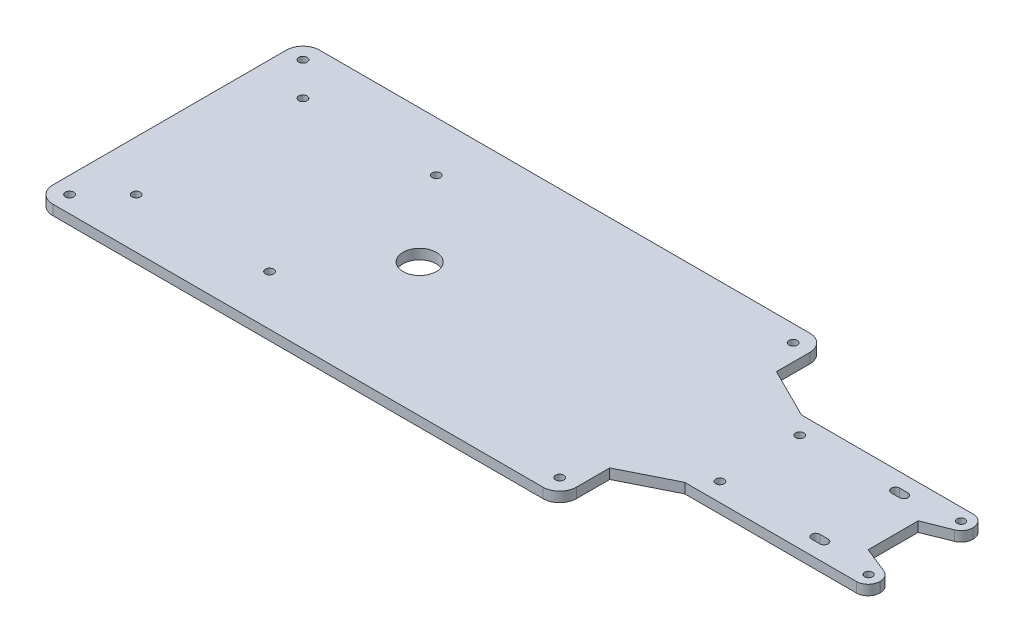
ISO-10303-21;
HEADER;
FILE_DESCRIPTION(('STEP AP214'),'2;1');
FILE_NAME('part.step','',(''),(''),'','','');
FILE_SCHEMA(('AUTOMOTIVE_DESIGN { 1 0 10303 214 1 1 1 1 }'));
ENDSEC;
DATA;
#1=APPLICATION_CONTEXT('core data for automotive mechanical design processes');
#2=APPLICATION_PROTOCOL_DEFINITION('international standard','automotive_design',2000,#1);
#3=PRODUCT_CONTEXT('',#1,'mechanical');
#4=PRODUCT('Part','Part','',(#3));
#5=PRODUCT_RELATED_PRODUCT_CATEGORY('part','',(#4));
#6=PRODUCT_DEFINITION_FORMATION('','',#4);
#7=PRODUCT_DEFINITION_CONTEXT('part definition',#1,'design');
#8=PRODUCT_DEFINITION('design','',#6,#7);
#9=PRODUCT_DEFINITION_SHAPE('','',#8);
#10=(LENGTH_UNIT() NAMED_UNIT(*) SI_UNIT(.MILLI.,.METRE.));
#11=(NAMED_UNIT(*) PLANE_ANGLE_UNIT() SI_UNIT($,.RADIAN.));
#12=(NAMED_UNIT(*) SI_UNIT($,.STERADIAN.) SOLID_ANGLE_UNIT());
#13=UNCERTAINTY_MEASURE_WITH_UNIT(LENGTH_MEASURE(1.E-05),#10,'distance_accuracy_value','');
#14=(GEOMETRIC_REPRESENTATION_CONTEXT(3) GLOBAL_UNCERTAINTY_ASSIGNED_CONTEXT((#13)) GLOBAL_UNIT_ASSIGNED_CONTEXT((#10,
#11,#12)) REPRESENTATION_CONTEXT('',''));
#15=CARTESIAN_POINT('',(0.,0.,0.));
#16=DIRECTION('',(0.,0.,1.));
#17=DIRECTION('',(1.,0.,0.));
#18=AXIS2_PLACEMENT_3D('',#15,#16,#17);
#19=CARTESIAN_POINT('',(223.5,3.,-14.));
#20=DIRECTION('',(0.,-1.,0.));
#21=DIRECTION('',(0.,0.,-1.));
#22=AXIS2_PLACEMENT_3D('',#19,#20,#21);
#23=PLANE('',#22);
#24=CARTESIAN_POINT('',(75.,3.,0.));
#25=DIRECTION('',(0.,1.,0.));
#26=DIRECTION('',(0.,0.,1.));
#27=AXIS2_PLACEMENT_3D('',#24,#25,#26);
#28=CIRCLE('',#27,5.);
#29=CARTESIAN_POINT('',(75.,3.,5.));
#30=VERTEX_POINT('',#29);
#31=EDGE_CURVE('E323',#30,#30,#28,.T.);
#32=ORIENTED_EDGE('',*,*,#31,.F.);
#33=EDGE_LOOP('',(#32));
#34=FACE_BOUND('',#33,.T.);
#35=CARTESIAN_POINT('',(177.024019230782,3.,11.975));
#36=DIRECTION('',(0.,1.,0.));
#37=DIRECTION('',(0.,0.,1.));
#38=AXIS2_PLACEMENT_3D('',#35,#36,#37);
#39=CIRCLE('',#38,1.25000000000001);
#40=CARTESIAN_POINT('',(177.024019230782,3.,13.225));
#41=VERTEX_POINT('',#40);
#42=EDGE_CURVE('E289',#41,#41,#39,.T.);
#43=ORIENTED_EDGE('',*,*,#42,.F.);
#44=EDGE_LOOP('',(#43));
#45=FACE_BOUND('',#44,.T.);
#46=DIRECTION('',(1.,0.,0.));
#47=VECTOR('',#46,1.);
#48=CARTESIAN_POINT('',(205.725980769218,3.,-10.725));
#49=LINE('',#48,#47);
#50=CARTESIAN_POINT('',(205.725980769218,3.,-10.725));
#51=VERTEX_POINT('',#50);
#52=CARTESIAN_POINT('',(208.225980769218,3.,-10.725));
#53=VERTEX_POINT('',#52);
#54=EDGE_CURVE('E447',#51,#53,#49,.T.);
#55=ORIENTED_EDGE('',*,*,#54,.F.);
#56=CARTESIAN_POINT('',(205.725980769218,3.,-11.975));
#57=DIRECTION('',(0.,1.,0.));
#58=DIRECTION('',(0.,0.,1.));
#59=AXIS2_PLACEMENT_3D('',#56,#57,#58);
#60=CIRCLE('',#59,1.25);
#61=CARTESIAN_POINT('',(205.725980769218,3.,-13.225));
#62=VERTEX_POINT('',#61);
#63=EDGE_CURVE('E68',#62,#51,#60,.T.);
#64=ORIENTED_EDGE('',*,*,#63,.F.);
#65=DIRECTION('',(-1.,0.,0.));
#66=VECTOR('',#65,1.);
#67=CARTESIAN_POINT('',(205.725980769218,3.,-13.225));
#68=LINE('',#67,#66);
#69=CARTESIAN_POINT('',(208.225980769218,3.,-13.225));
#70=VERTEX_POINT('',#69);
#71=EDGE_CURVE('E460',#70,#62,#68,.T.);
#72=ORIENTED_EDGE('',*,*,#71,.F.);
#73=CARTESIAN_POINT('',(208.225980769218,3.,-11.975));
#74=DIRECTION('',(0.,1.,0.));
#75=DIRECTION('',(0.,0.,1.));
#76=AXIS2_PLACEMENT_3D('',#73,#74,#75);
#77=CIRCLE('',#76,1.25);
#78=EDGE_CURVE('E453',#53,#70,#77,.T.);
#79=ORIENTED_EDGE('',*,*,#78,.F.);
#80=EDGE_LOOP('',(#55,#64,#72,#79));
#81=FACE_BOUND('',#80,.T.);
#82=DIRECTION('',(1.,0.,0.));
#83=VECTOR('',#82,1.);
#84=CARTESIAN_POINT('',(205.725980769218,3.,13.225));
#85=LINE('',#84,#83);
#86=CARTESIAN_POINT('',(205.725980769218,3.,13.225));
#87=VERTEX_POINT('',#86);
#88=CARTESIAN_POINT('',(208.225980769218,3.,13.225));
#89=VERTEX_POINT('',#88);
#90=EDGE_CURVE('E273',#87,#89,#85,.T.);
#91=ORIENTED_EDGE('',*,*,#90,.F.);
#92=CARTESIAN_POINT('',(205.725980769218,3.,11.975));
#93=DIRECTION('',(0.,1.,0.));
#94=DIRECTION('',(0.,0.,1.));
#95=AXIS2_PLACEMENT_3D('',#92,#93,#94);
#96=CIRCLE('',#95,1.25);
#97=CARTESIAN_POINT('',(205.725980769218,3.,10.725));
#98=VERTEX_POINT('',#97);
#99=EDGE_CURVE('E76',#98,#87,#96,.T.);
#100=ORIENTED_EDGE('',*,*,#99,.F.);
#101=DIRECTION('',(-1.,0.,0.));
#102=VECTOR('',#101,1.);
#103=CARTESIAN_POINT('',(205.725980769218,3.,10.725));
#104=LINE('',#103,#102);
#105=CARTESIAN_POINT('',(208.225980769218,3.,10.725));
#106=VERTEX_POINT('',#105);
#107=EDGE_CURVE('E260',#106,#98,#104,.T.);
#108=ORIENTED_EDGE('',*,*,#107,.F.);
#109=CARTESIAN_POINT('',(208.225980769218,3.,11.975));
#110=DIRECTION('',(0.,1.,0.));
#111=DIRECTION('',(0.,0.,1.));
#112=AXIS2_PLACEMENT_3D('',#109,#110,#111);
#113=CIRCLE('',#112,1.25);
#114=EDGE_CURVE('E267',#89,#106,#113,.T.);
#115=ORIENTED_EDGE('',*,*,#114,.F.);
#116=EDGE_LOOP('',(#91,#100,#108,#115));
#117=FACE_BOUND('',#116,.T.);
#118=CARTESIAN_POINT('',(177.024019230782,3.,-11.975));
#119=DIRECTION('',(0.,1.,0.));
#120=DIRECTION('',(0.,0.,1.));
#121=AXIS2_PLACEMENT_3D('',#118,#119,#120);
#122=CIRCLE('',#121,1.25000000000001);
#123=CARTESIAN_POINT('',(177.024019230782,3.,-10.725));
#124=VERTEX_POINT('',#123);
#125=EDGE_CURVE('E439',#124,#124,#122,.T.);
#126=ORIENTED_EDGE('',*,*,#125,.F.);
#127=EDGE_LOOP('',(#126));
#128=FACE_BOUND('',#127,.T.);
#129=CARTESIAN_POINT('',(5.,3.,35.));
#130=DIRECTION('',(0.,1.,0.));
#131=DIRECTION('',(0.,0.,1.));
#132=AXIS2_PLACEMENT_3D('',#129,#130,#131);
#133=CIRCLE('',#132,1.25);
#134=CARTESIAN_POINT('',(5.,3.,36.25));
#135=VERTEX_POINT('',#134);
#136=EDGE_CURVE('E737',#135,#135,#133,.T.);
#137=ORIENTED_EDGE('',*,*,#136,.F.);
#138=EDGE_LOOP('',(#137));
#139=FACE_BOUND('',#138,.T.);
#140=CARTESIAN_POINT('',(152.,3.,-35.));
#141=DIRECTION('',(0.,1.,0.));
#142=DIRECTION('',(0.,0.,1.));
#143=AXIS2_PLACEMENT_3D('',#140,#141,#142);
#144=CIRCLE('',#143,1.25000000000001);
#145=CARTESIAN_POINT('',(152.,3.,-33.75));
#146=VERTEX_POINT('',#145);
#147=EDGE_CURVE('E738',#146,#146,#144,.T.);
#148=ORIENTED_EDGE('',*,*,#147,.F.);
#149=EDGE_LOOP('',(#148));
#150=FACE_BOUND('',#149,.T.);
#151=CARTESIAN_POINT('',(152.,3.,35.));
#152=DIRECTION('',(0.,1.,0.));
#153=DIRECTION('',(0.,0.,1.));
#154=AXIS2_PLACEMENT_3D('',#151,#152,#153);
#155=CIRCLE('',#154,1.25000000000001);
#156=CARTESIAN_POINT('',(152.,3.,36.25));
#157=VERTEX_POINT('',#156);
#158=EDGE_CURVE('E331',#157,#157,#155,.T.);
#159=ORIENTED_EDGE('',*,*,#158,.F.);
#160=EDGE_LOOP('',(#159));
#161=FACE_BOUND('',#160,.T.);
#162=CARTESIAN_POINT('',(5.,3.,-35.));
#163=DIRECTION('',(0.,1.,0.));
#164=DIRECTION('',(0.,0.,1.));
#165=AXIS2_PLACEMENT_3D('',#162,#163,#164);
#166=CIRCLE('',#165,1.25);
#167=CARTESIAN_POINT('',(5.,3.,-33.75));
#168=VERTEX_POINT('',#167);
#169=EDGE_CURVE('E485',#168,#168,#166,.T.);
#170=ORIENTED_EDGE('',*,*,#169,.F.);
#171=EDGE_LOOP('',(#170));
#172=FACE_BOUND('',#171,.T.);
#173=CARTESIAN_POINT('',(15.,3.,25.));
#174=DIRECTION('',(0.,-1.,0.));
#175=DIRECTION('',(0.,0.,-1.));
#176=AXIS2_PLACEMENT_3D('',#173,#174,#175);
#177=CIRCLE('',#176,1.25);
#178=CARTESIAN_POINT('',(15.,3.,23.75));
#179=VERTEX_POINT('',#178);
#180=EDGE_CURVE('E533',#179,#179,#177,.T.);
#181=ORIENTED_EDGE('',*,*,#180,.T.);
#182=EDGE_LOOP('',(#181));
#183=FACE_BOUND('',#182,.T.);
#184=CARTESIAN_POINT('',(55.,3.,25.));
#185=DIRECTION('',(0.,-1.,0.));
#186=DIRECTION('',(0.,0.,-1.));
#187=AXIS2_PLACEMENT_3D('',#184,#185,#186);
#188=CIRCLE('',#187,1.25);
#189=CARTESIAN_POINT('',(55.,3.,23.75));
#190=VERTEX_POINT('',#189);
#191=EDGE_CURVE('E527',#190,#190,#188,.T.);
#192=ORIENTED_EDGE('',*,*,#191,.T.);
#193=EDGE_LOOP('',(#192));
#194=FACE_BOUND('',#193,.T.);
#195=CARTESIAN_POINT('',(55.,3.,-25.));
#196=DIRECTION('',(0.,-1.,0.));
#197=DIRECTION('',(0.,0.,-1.));
#198=AXIS2_PLACEMENT_3D('',#195,#196,#197);
#199=CIRCLE('',#198,1.25);
#200=CARTESIAN_POINT('',(55.,3.,-26.25));
#201=VERTEX_POINT('',#200);
#202=EDGE_CURVE('E393',#201,#201,#199,.T.);
#203=ORIENTED_EDGE('',*,*,#202,.T.);
#204=EDGE_LOOP('',(#203));
#205=FACE_BOUND('',#204,.T.);
#206=CARTESIAN_POINT('',(15.,3.,-25.));
#207=DIRECTION('',(0.,-1.,0.));
#208=DIRECTION('',(0.,0.,-1.));
#209=AXIS2_PLACEMENT_3D('',#206,#207,#208);
#210=CIRCLE('',#209,1.25);
#211=CARTESIAN_POINT('',(15.,3.,-26.25));
#212=VERTEX_POINT('',#211);
#213=EDGE_CURVE('E389',#212,#212,#210,.T.);
#214=ORIENTED_EDGE('',*,*,#213,.T.);
#215=EDGE_LOOP('',(#214));
#216=FACE_BOUND('',#215,.T.);
#217=DIRECTION('',(1.,0.,0.));
#218=VECTOR('',#217,1.);
#219=CARTESIAN_POINT('',(0.,3.,40.));
#220=LINE('',#219,#218);
#221=CARTESIAN_POINT('',(5.,3.,40.));
#222=VERTEX_POINT('',#221);
#223=CARTESIAN_POINT('',(152.,3.,40.));
#224=VERTEX_POINT('',#223);
#225=EDGE_CURVE('E564',#222,#224,#220,.T.);
#226=ORIENTED_EDGE('',*,*,#225,.T.);
#227=CARTESIAN_POINT('',(152.,3.,35.));
#228=DIRECTION('',(0.,-1.,0.));
#229=DIRECTION('',(0.,0.,-1.));
#230=AXIS2_PLACEMENT_3D('',#227,#228,#229);
#231=CIRCLE('',#230,5.);
#232=CARTESIAN_POINT('',(157.,3.,35.));
#233=VERTEX_POINT('',#232);
#234=EDGE_CURVE('E376',#224,#233,#231,.F.);
#235=ORIENTED_EDGE('',*,*,#234,.T.);
#236=DIRECTION('',(0.,0.,-1.));
#237=VECTOR('',#236,1.);
#238=CARTESIAN_POINT('',(157.,3.,40.));
#239=LINE('',#238,#237);
#240=CARTESIAN_POINT('',(157.,3.,25.));
#241=VERTEX_POINT('',#240);
#242=EDGE_CURVE('E1060',#233,#241,#239,.T.);
#243=ORIENTED_EDGE('',*,*,#242,.T.);
#244=DIRECTION('',(0.894427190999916,0.,-0.447213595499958));
#245=VECTOR('',#244,1.);
#246=CARTESIAN_POINT('',(157.,3.,25.));
#247=LINE('',#246,#245);
#248=CARTESIAN_POINT('',(172.,3.,17.5));
#249=VERTEX_POINT('',#248);
#250=EDGE_CURVE('E385',#241,#249,#247,.T.);
#251=ORIENTED_EDGE('',*,*,#250,.T.);
#252=DIRECTION('',(1.,0.,0.));
#253=VECTOR('',#252,1.);
#254=CARTESIAN_POINT('',(172.,3.,17.5));
#255=LINE('',#254,#253);
#256=CARTESIAN_POINT('',(223.5,3.,17.5));
#257=VERTEX_POINT('',#256);
#258=EDGE_CURVE('E381',#249,#257,#255,.T.);
#259=ORIENTED_EDGE('',*,*,#258,.T.);
#260=CARTESIAN_POINT('',(223.5,3.,14.));
#261=DIRECTION('',(0.,1.,0.));
#262=DIRECTION('',(0.,0.,1.));
#263=AXIS2_PLACEMENT_3D('',#260,#261,#262);
#264=CIRCLE('',#263,3.5);
#265=CARTESIAN_POINT('',(227.,3.,14.));
#266=VERTEX_POINT('',#265);
#267=EDGE_CURVE('E384',#257,#266,#264,.T.);
#268=ORIENTED_EDGE('',*,*,#267,.T.);
#269=DIRECTION('',(2.12874589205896E-13,0.,-1.));
#270=VECTOR('',#269,1.);
#271=CARTESIAN_POINT('',(227.,3.,13.8696153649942));
#272=LINE('',#271,#270);
#273=CARTESIAN_POINT('',(227.,3.,13.8696153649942));
#274=VERTEX_POINT('',#273);
#275=EDGE_CURVE('E604',#266,#274,#272,.T.);
#276=ORIENTED_EDGE('',*,*,#275,.T.);
#277=CARTESIAN_POINT('',(223.5,3.,13.8696153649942));
#278=DIRECTION('',(0.,1.,0.));
#279=DIRECTION('',(0.,0.,-1.));
#280=AXIS2_PLACEMENT_3D('',#277,#278,#279);
#281=CIRCLE('',#280,3.50000000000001);
#282=CARTESIAN_POINT('',(224.799867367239,3.,10.6199469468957));
#283=VERTEX_POINT('',#282);
#284=EDGE_CURVE('E598',#274,#283,#281,.T.);
#285=ORIENTED_EDGE('',*,*,#284,.T.);
#286=DIRECTION('',(-0.92847669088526,0.,-0.371390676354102));
#287=VECTOR('',#286,1.);
#288=CARTESIAN_POINT('',(217.,3.,7.5));
#289=LINE('',#288,#287);
#290=CARTESIAN_POINT('',(217.,3.,7.5));
#291=VERTEX_POINT('',#290);
#292=EDGE_CURVE('E595',#283,#291,#289,.T.);
#293=ORIENTED_EDGE('',*,*,#292,.T.);
#294=DIRECTION('',(0.,0.,-1.));
#295=VECTOR('',#294,1.);
#296=CARTESIAN_POINT('',(217.,3.,-7.5));
#297=LINE('',#296,#295);
#298=CARTESIAN_POINT('',(217.,3.,-7.5));
#299=VERTEX_POINT('',#298);
#300=EDGE_CURVE('E597',#291,#299,#297,.T.);
#301=ORIENTED_EDGE('',*,*,#300,.T.);
#302=DIRECTION('',(0.92847669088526,0.,-0.371390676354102));
#303=VECTOR('',#302,1.);
#304=CARTESIAN_POINT('',(217.,3.,-7.5));
#305=LINE('',#304,#303);
#306=CARTESIAN_POINT('',(224.799867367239,3.,-10.6199469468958));
#307=VERTEX_POINT('',#306);
#308=EDGE_CURVE('E522',#299,#307,#305,.T.);
#309=ORIENTED_EDGE('',*,*,#308,.T.);
#310=CARTESIAN_POINT('',(223.5,3.,-13.8696153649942));
#311=DIRECTION('',(0.,1.,0.));
#312=DIRECTION('',(0.,0.,1.));
#313=AXIS2_PLACEMENT_3D('',#310,#311,#312);
#314=CIRCLE('',#313,3.50000000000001);
#315=CARTESIAN_POINT('',(227.,3.,-13.8696153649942));
#316=VERTEX_POINT('',#315);
#317=EDGE_CURVE('E519',#307,#316,#314,.T.);
#318=ORIENTED_EDGE('',*,*,#317,.T.);
#319=DIRECTION('',(-2.12874589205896E-13,0.,-1.));
#320=VECTOR('',#319,1.);
#321=CARTESIAN_POINT('',(227.,3.,-13.8696153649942));
#322=LINE('',#321,#320);
#323=CARTESIAN_POINT('',(227.,3.,-14.));
#324=VERTEX_POINT('',#323);
#325=EDGE_CURVE('E521',#316,#324,#322,.T.);
#326=ORIENTED_EDGE('',*,*,#325,.T.);
#327=CARTESIAN_POINT('',(223.5,3.,-14.));
#328=DIRECTION('',(0.,1.,0.));
#329=DIRECTION('',(0.,0.,-1.));
#330=AXIS2_PLACEMENT_3D('',#327,#328,#329);
#331=CIRCLE('',#330,3.5);
#332=CARTESIAN_POINT('',(223.5,3.,-17.5));
#333=VERTEX_POINT('',#332);
#334=EDGE_CURVE('E592',#324,#333,#331,.T.);
#335=ORIENTED_EDGE('',*,*,#334,.T.);
#336=DIRECTION('',(-1.,0.,0.));
#337=VECTOR('',#336,1.);
#338=CARTESIAN_POINT('',(172.,3.,-17.5));
#339=LINE('',#338,#337);
#340=CARTESIAN_POINT('',(172.,3.,-17.5));
#341=VERTEX_POINT('',#340);
#342=EDGE_CURVE('E617',#333,#341,#339,.T.);
#343=ORIENTED_EDGE('',*,*,#342,.T.);
#344=DIRECTION('',(-0.894427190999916,0.,-0.447213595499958));
#345=VECTOR('',#344,1.);
#346=CARTESIAN_POINT('',(157.,3.,-25.));
#347=LINE('',#346,#345);
#348=CARTESIAN_POINT('',(157.,3.,-25.));
#349=VERTEX_POINT('',#348);
#350=EDGE_CURVE('E613',#341,#349,#347,.T.);
#351=ORIENTED_EDGE('',*,*,#350,.T.);
#352=DIRECTION('',(0.,0.,-1.));
#353=VECTOR('',#352,1.);
#354=CARTESIAN_POINT('',(157.,3.,-40.));
#355=LINE('',#354,#353);
#356=CARTESIAN_POINT('',(157.,3.,-35.));
#357=VERTEX_POINT('',#356);
#358=EDGE_CURVE('E704',#349,#357,#355,.T.);
#359=ORIENTED_EDGE('',*,*,#358,.T.);
#360=CARTESIAN_POINT('',(152.,3.,-35.));
#361=DIRECTION('',(0.,-1.,0.));
#362=DIRECTION('',(0.,0.,-1.));
#363=AXIS2_PLACEMENT_3D('',#360,#361,#362);
#364=CIRCLE('',#363,5.);
#365=CARTESIAN_POINT('',(152.,3.,-40.));
#366=VERTEX_POINT('',#365);
#367=EDGE_CURVE('E373',#357,#366,#364,.F.);
#368=ORIENTED_EDGE('',*,*,#367,.T.);
#369=DIRECTION('',(-1.,0.,0.));
#370=VECTOR('',#369,1.);
#371=CARTESIAN_POINT('',(77.,3.,-40.));
#372=LINE('',#371,#370);
#373=CARTESIAN_POINT('',(5.,3.,-40.));
#374=VERTEX_POINT('',#373);
#375=EDGE_CURVE('E565',#366,#374,#372,.T.);
#376=ORIENTED_EDGE('',*,*,#375,.T.);
#377=CARTESIAN_POINT('',(5.,3.,-35.));
#378=DIRECTION('',(0.,-1.,0.));
#379=DIRECTION('',(0.,0.,-1.));
#380=AXIS2_PLACEMENT_3D('',#377,#378,#379);
#381=CIRCLE('',#380,5.);
#382=CARTESIAN_POINT('',(0.,3.,-35.));
#383=VERTEX_POINT('',#382);
#384=EDGE_CURVE('E492',#374,#383,#381,.F.);
#385=ORIENTED_EDGE('',*,*,#384,.T.);
#386=DIRECTION('',(0.,0.,1.));
#387=VECTOR('',#386,1.);
#388=CARTESIAN_POINT('',(0.,3.,-40.));
#389=LINE('',#388,#387);
#390=CARTESIAN_POINT('',(0.,3.,35.));
#391=VERTEX_POINT('',#390);
#392=EDGE_CURVE('E561',#383,#391,#389,.T.);
#393=ORIENTED_EDGE('',*,*,#392,.T.);
#394=CARTESIAN_POINT('',(5.,3.,35.));
#395=DIRECTION('',(0.,-1.,0.));
#396=DIRECTION('',(0.,0.,-1.));
#397=AXIS2_PLACEMENT_3D('',#394,#395,#396);
#398=CIRCLE('',#397,5.);
#399=EDGE_CURVE('E377',#391,#222,#398,.F.);
#400=ORIENTED_EDGE('',*,*,#399,.T.);
#401=EDGE_LOOP('',(#226,#235,#243,#251,#259,#268,#276,#285,#293,#301,#309,#318,#326,#335,#343,
#351,#359,#368,#376,#385,#393,#400));
#402=FACE_BOUND('',#401,.T.);
#403=CARTESIAN_POINT('',(223.5,3.,-13.8696153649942));
#404=DIRECTION('',(0.,1.,0.));
#405=DIRECTION('',(0.,0.,1.));
#406=AXIS2_PLACEMENT_3D('',#403,#404,#405);
#407=CIRCLE('',#406,1.20000000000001);
#408=CARTESIAN_POINT('',(223.5,3.,-12.6696153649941));
#409=VERTEX_POINT('',#408);
#410=EDGE_CURVE('E435',#409,#409,#407,.T.);
#411=ORIENTED_EDGE('',*,*,#410,.F.);
#412=EDGE_LOOP('',(#411));
#413=FACE_BOUND('',#412,.T.);
#414=CARTESIAN_POINT('',(223.5,3.,13.8696153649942));
#415=DIRECTION('',(0.,1.,0.));
#416=DIRECTION('',(0.,0.,-1.));
#417=AXIS2_PLACEMENT_3D('',#414,#415,#416);
#418=CIRCLE('',#417,1.20000000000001);
#419=CARTESIAN_POINT('',(223.5,3.,12.6696153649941));
#420=VERTEX_POINT('',#419);
#421=EDGE_CURVE('E546',#420,#420,#418,.T.);
#422=ORIENTED_EDGE('',*,*,#421,.F.);
#423=EDGE_LOOP('',(#422));
#424=FACE_BOUND('',#423,.T.);
#425=ADVANCED_FACE('F50',(#34,#45,#81,#117,#128,#139,#150,#161,#172,#183,#194,#205,#216,#402,
#413,#424),#23,.F.);
#426=CARTESIAN_POINT('',(223.5,0.,-14.));
#427=DIRECTION('',(0.,-1.,0.));
#428=DIRECTION('',(0.,0.,-1.));
#429=AXIS2_PLACEMENT_3D('',#426,#427,#428);
#430=PLANE('',#429);
#431=CARTESIAN_POINT('',(75.,0.,0.));
#432=DIRECTION('',(0.,-1.,0.));
#433=DIRECTION('',(0.,0.,-1.));
#434=AXIS2_PLACEMENT_3D('',#431,#432,#433);
#435=CIRCLE('',#434,5.);
#436=CARTESIAN_POINT('',(75.,0.,-5.));
#437=VERTEX_POINT('',#436);
#438=EDGE_CURVE('E54',#437,#437,#435,.T.);
#439=ORIENTED_EDGE('',*,*,#438,.F.);
#440=EDGE_LOOP('',(#439));
#441=FACE_BOUND('',#440,.T.);
#442=CARTESIAN_POINT('',(177.024019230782,0.,11.975));
#443=DIRECTION('',(0.,-1.,0.));
#444=DIRECTION('',(0.,0.,-1.));
#445=AXIS2_PLACEMENT_3D('',#442,#443,#444);
#446=CIRCLE('',#445,1.25000000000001);
#447=CARTESIAN_POINT('',(177.024019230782,0.,10.725));
#448=VERTEX_POINT('',#447);
#449=EDGE_CURVE('E671',#448,#448,#446,.T.);
#450=ORIENTED_EDGE('',*,*,#449,.F.);
#451=EDGE_LOOP('',(#450));
#452=FACE_BOUND('',#451,.T.);
#453=CARTESIAN_POINT('',(205.725980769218,0.,-11.975));
#454=DIRECTION('',(0.,-1.,0.));
#455=DIRECTION('',(0.,0.,-1.));
#456=AXIS2_PLACEMENT_3D('',#453,#454,#455);
#457=CIRCLE('',#456,1.25);
#458=CARTESIAN_POINT('',(205.725980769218,0.,-10.725));
#459=VERTEX_POINT('',#458);
#460=CARTESIAN_POINT('',(205.725980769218,0.,-13.225));
#461=VERTEX_POINT('',#460);
#462=EDGE_CURVE('E12',#459,#461,#457,.T.);
#463=ORIENTED_EDGE('',*,*,#462,.F.);
#464=DIRECTION('',(-1.,0.,0.));
#465=VECTOR('',#464,1.);
#466=CARTESIAN_POINT('',(223.5,0.,-10.725));
#467=LINE('',#466,#465);
#468=CARTESIAN_POINT('',(208.225980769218,0.,-10.725));
#469=VERTEX_POINT('',#468);
#470=EDGE_CURVE('E366',#469,#459,#467,.T.);
#471=ORIENTED_EDGE('',*,*,#470,.F.);
#472=CARTESIAN_POINT('',(208.225980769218,0.,-11.975));
#473=DIRECTION('',(0.,-1.,0.));
#474=DIRECTION('',(0.,0.,-1.));
#475=AXIS2_PLACEMENT_3D('',#472,#473,#474);
#476=CIRCLE('',#475,1.25);
#477=CARTESIAN_POINT('',(208.225980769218,0.,-13.225));
#478=VERTEX_POINT('',#477);
#479=EDGE_CURVE('E369',#478,#469,#476,.T.);
#480=ORIENTED_EDGE('',*,*,#479,.F.);
#481=DIRECTION('',(1.,0.,0.));
#482=VECTOR('',#481,1.);
#483=CARTESIAN_POINT('',(223.5,0.,-13.225));
#484=LINE('',#483,#482);
#485=EDGE_CURVE('E60',#461,#478,#484,.T.);
#486=ORIENTED_EDGE('',*,*,#485,.F.);
#487=EDGE_LOOP('',(#463,#471,#480,#486));
#488=FACE_BOUND('',#487,.T.);
#489=CARTESIAN_POINT('',(205.725980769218,0.,11.975));
#490=DIRECTION('',(0.,-1.,0.));
#491=DIRECTION('',(0.,0.,-1.));
#492=AXIS2_PLACEMENT_3D('',#489,#490,#491);
#493=CIRCLE('',#492,1.25);
#494=CARTESIAN_POINT('',(205.725980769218,0.,13.225));
#495=VERTEX_POINT('',#494);
#496=CARTESIAN_POINT('',(205.725980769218,0.,10.725));
#497=VERTEX_POINT('',#496);
#498=EDGE_CURVE('E253',#495,#497,#493,.T.);
#499=ORIENTED_EDGE('',*,*,#498,.F.);
#500=DIRECTION('',(-1.,0.,0.));
#501=VECTOR('',#500,1.);
#502=CARTESIAN_POINT('',(223.5,0.,13.225));
#503=LINE('',#502,#501);
#504=CARTESIAN_POINT('',(208.225980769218,0.,13.225));
#505=VERTEX_POINT('',#504);
#506=EDGE_CURVE('E316',#505,#495,#503,.T.);
#507=ORIENTED_EDGE('',*,*,#506,.F.);
#508=CARTESIAN_POINT('',(208.225980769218,0.,11.975));
#509=DIRECTION('',(0.,-1.,0.));
#510=DIRECTION('',(0.,0.,-1.));
#511=AXIS2_PLACEMENT_3D('',#508,#509,#510);
#512=CIRCLE('',#511,1.25);
#513=CARTESIAN_POINT('',(208.225980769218,0.,10.725));
#514=VERTEX_POINT('',#513);
#515=EDGE_CURVE('E310',#514,#505,#512,.T.);
#516=ORIENTED_EDGE('',*,*,#515,.F.);
#517=DIRECTION('',(1.,0.,0.));
#518=VECTOR('',#517,1.);
#519=CARTESIAN_POINT('',(223.5,0.,10.725));
#520=LINE('',#519,#518);
#521=EDGE_CURVE('E362',#497,#514,#520,.T.);
#522=ORIENTED_EDGE('',*,*,#521,.F.);
#523=EDGE_LOOP('',(#499,#507,#516,#522));
#524=FACE_BOUND('',#523,.T.);
#525=CARTESIAN_POINT('',(177.024019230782,0.,-11.975));
#526=DIRECTION('',(0.,-1.,0.));
#527=DIRECTION('',(0.,0.,-1.));
#528=AXIS2_PLACEMENT_3D('',#525,#526,#527);
#529=CIRCLE('',#528,1.25000000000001);
#530=CARTESIAN_POINT('',(177.024019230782,0.,-13.225));
#531=VERTEX_POINT('',#530);
#532=EDGE_CURVE('E442',#531,#531,#529,.T.);
#533=ORIENTED_EDGE('',*,*,#532,.F.);
#534=EDGE_LOOP('',(#533));
#535=FACE_BOUND('',#534,.T.);
#536=CARTESIAN_POINT('',(5.,0.,35.));
#537=DIRECTION('',(0.,-1.,0.));
#538=DIRECTION('',(0.,0.,-1.));
#539=AXIS2_PLACEMENT_3D('',#536,#537,#538);
#540=CIRCLE('',#539,1.25);
#541=CARTESIAN_POINT('',(5.,0.,33.75));
#542=VERTEX_POINT('',#541);
#543=EDGE_CURVE('E509',#542,#542,#540,.T.);
#544=ORIENTED_EDGE('',*,*,#543,.F.);
#545=EDGE_LOOP('',(#544));
#546=FACE_BOUND('',#545,.T.);
#547=CARTESIAN_POINT('',(152.,0.,-35.));
#548=DIRECTION('',(0.,-1.,0.));
#549=DIRECTION('',(0.,0.,-1.));
#550=AXIS2_PLACEMENT_3D('',#547,#548,#549);
#551=CIRCLE('',#550,1.25000000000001);
#552=CARTESIAN_POINT('',(152.,0.,-36.25));
#553=VERTEX_POINT('',#552);
#554=EDGE_CURVE('E505',#553,#553,#551,.T.);
#555=ORIENTED_EDGE('',*,*,#554,.F.);
#556=EDGE_LOOP('',(#555));
#557=FACE_BOUND('',#556,.T.);
#558=CARTESIAN_POINT('',(152.,0.,35.));
#559=DIRECTION('',(0.,-1.,0.));
#560=DIRECTION('',(0.,0.,-1.));
#561=AXIS2_PLACEMENT_3D('',#558,#559,#560);
#562=CIRCLE('',#561,1.25000000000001);
#563=CARTESIAN_POINT('',(152.,0.,33.75));
#564=VERTEX_POINT('',#563);
#565=EDGE_CURVE('E510',#564,#564,#562,.T.);
#566=ORIENTED_EDGE('',*,*,#565,.F.);
#567=EDGE_LOOP('',(#566));
#568=FACE_BOUND('',#567,.T.);
#569=CARTESIAN_POINT('',(5.,0.,-35.));
#570=DIRECTION('',(0.,-1.,0.));
#571=DIRECTION('',(0.,0.,-1.));
#572=AXIS2_PLACEMENT_3D('',#569,#570,#571);
#573=CIRCLE('',#572,1.25);
#574=CARTESIAN_POINT('',(5.,0.,-36.25));
#575=VERTEX_POINT('',#574);
#576=EDGE_CURVE('E666',#575,#575,#573,.T.);
#577=ORIENTED_EDGE('',*,*,#576,.F.);
#578=EDGE_LOOP('',(#577));
#579=FACE_BOUND('',#578,.T.);
#580=CARTESIAN_POINT('',(15.,0.,25.));
#581=DIRECTION('',(0.,1.,0.));
#582=DIRECTION('',(0.,0.,1.));
#583=AXIS2_PLACEMENT_3D('',#580,#581,#582);
#584=CIRCLE('',#583,1.25);
#585=CARTESIAN_POINT('',(15.,0.,26.25));
#586=VERTEX_POINT('',#585);
#587=EDGE_CURVE('E587',#586,#586,#584,.T.);
#588=ORIENTED_EDGE('',*,*,#587,.T.);
#589=EDGE_LOOP('',(#588));
#590=FACE_BOUND('',#589,.T.);
#591=CARTESIAN_POINT('',(55.,0.,25.));
#592=DIRECTION('',(0.,1.,0.));
#593=DIRECTION('',(0.,0.,1.));
#594=AXIS2_PLACEMENT_3D('',#591,#592,#593);
#595=CIRCLE('',#594,1.25);
#596=CARTESIAN_POINT('',(55.,0.,26.25));
#597=VERTEX_POINT('',#596);
#598=EDGE_CURVE('E356',#597,#597,#595,.T.);
#599=ORIENTED_EDGE('',*,*,#598,.T.);
#600=EDGE_LOOP('',(#599));
#601=FACE_BOUND('',#600,.T.);
#602=CARTESIAN_POINT('',(55.,0.,-25.));
#603=DIRECTION('',(0.,1.,0.));
#604=DIRECTION('',(0.,0.,1.));
#605=AXIS2_PLACEMENT_3D('',#602,#603,#604);
#606=CIRCLE('',#605,1.25);
#607=CARTESIAN_POINT('',(55.,0.,-23.75));
#608=VERTEX_POINT('',#607);
#609=EDGE_CURVE('E351',#608,#608,#606,.T.);
#610=ORIENTED_EDGE('',*,*,#609,.T.);
#611=EDGE_LOOP('',(#610));
#612=FACE_BOUND('',#611,.T.);
#613=CARTESIAN_POINT('',(15.,0.,-25.));
#614=DIRECTION('',(0.,1.,0.));
#615=DIRECTION('',(0.,0.,1.));
#616=AXIS2_PLACEMENT_3D('',#613,#614,#615);
#617=CIRCLE('',#616,1.25);
#618=CARTESIAN_POINT('',(15.,0.,-23.75));
#619=VERTEX_POINT('',#618);
#620=EDGE_CURVE('E355',#619,#619,#617,.T.);
#621=ORIENTED_EDGE('',*,*,#620,.T.);
#622=EDGE_LOOP('',(#621));
#623=FACE_BOUND('',#622,.T.);
#624=CARTESIAN_POINT('',(223.5,0.,-13.8696153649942));
#625=DIRECTION('',(0.,1.,0.));
#626=DIRECTION('',(0.,0.,1.));
#627=AXIS2_PLACEMENT_3D('',#624,#625,#626);
#628=CIRCLE('',#627,1.20000000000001);
#629=CARTESIAN_POINT('',(223.5,0.,-12.6696153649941));
#630=VERTEX_POINT('',#629);
#631=EDGE_CURVE('E516',#630,#630,#628,.T.);
#632=ORIENTED_EDGE('',*,*,#631,.T.);
#633=EDGE_LOOP('',(#632));
#634=FACE_BOUND('',#633,.T.);
#635=DIRECTION('',(0.,0.,-1.));
#636=VECTOR('',#635,1.);
#637=CARTESIAN_POINT('',(157.,0.,40.));
#638=LINE('',#637,#636);
#639=CARTESIAN_POINT('',(157.,0.,35.));
#640=VERTEX_POINT('',#639);
#641=CARTESIAN_POINT('',(157.,0.,25.));
#642=VERTEX_POINT('',#641);
#643=EDGE_CURVE('E409',#640,#642,#638,.T.);
#644=ORIENTED_EDGE('',*,*,#643,.F.);
#645=CARTESIAN_POINT('',(152.,0.,35.));
#646=DIRECTION('',(0.,-1.,0.));
#647=DIRECTION('',(0.,0.,-1.));
#648=AXIS2_PLACEMENT_3D('',#645,#646,#647);
#649=CIRCLE('',#648,5.);
#650=CARTESIAN_POINT('',(152.,0.,40.));
#651=VERTEX_POINT('',#650);
#652=EDGE_CURVE('E989',#640,#651,#649,.T.);
#653=ORIENTED_EDGE('',*,*,#652,.T.);
#654=DIRECTION('',(1.,0.,0.));
#655=VECTOR('',#654,1.);
#656=CARTESIAN_POINT('',(77.,0.,40.));
#657=LINE('',#656,#655);
#658=CARTESIAN_POINT('',(5.,0.,40.));
#659=VERTEX_POINT('',#658);
#660=EDGE_CURVE('E413',#659,#651,#657,.T.);
#661=ORIENTED_EDGE('',*,*,#660,.F.);
#662=CARTESIAN_POINT('',(5.,0.,35.));
#663=DIRECTION('',(0.,-1.,0.));
#664=DIRECTION('',(0.,0.,-1.));
#665=AXIS2_PLACEMENT_3D('',#662,#663,#664);
#666=CIRCLE('',#665,5.);
#667=CARTESIAN_POINT('',(0.,0.,35.));
#668=VERTEX_POINT('',#667);
#669=EDGE_CURVE('E578',#659,#668,#666,.T.);
#670=ORIENTED_EDGE('',*,*,#669,.T.);
#671=DIRECTION('',(0.,0.,1.));
#672=VECTOR('',#671,1.);
#673=CARTESIAN_POINT('',(0.,0.,30.));
#674=LINE('',#673,#672);
#675=CARTESIAN_POINT('',(0.,0.,-35.));
#676=VERTEX_POINT('',#675);
#677=EDGE_CURVE('E416',#676,#668,#674,.T.);
#678=ORIENTED_EDGE('',*,*,#677,.F.);
#679=CARTESIAN_POINT('',(5.,0.,-35.));
#680=DIRECTION('',(0.,-1.,0.));
#681=DIRECTION('',(0.,0.,-1.));
#682=AXIS2_PLACEMENT_3D('',#679,#680,#681);
#683=CIRCLE('',#682,5.);
#684=CARTESIAN_POINT('',(5.,0.,-40.));
#685=VERTEX_POINT('',#684);
#686=EDGE_CURVE('E582',#676,#685,#683,.T.);
#687=ORIENTED_EDGE('',*,*,#686,.T.);
#688=DIRECTION('',(-1.,0.,0.));
#689=VECTOR('',#688,1.);
#690=CARTESIAN_POINT('',(77.,0.,-40.));
#691=LINE('',#690,#689);
#692=CARTESIAN_POINT('',(152.,0.,-40.));
#693=VERTEX_POINT('',#692);
#694=EDGE_CURVE('E434',#693,#685,#691,.T.);
#695=ORIENTED_EDGE('',*,*,#694,.F.);
#696=CARTESIAN_POINT('',(152.,0.,-35.));
#697=DIRECTION('',(0.,-1.,0.));
#698=DIRECTION('',(0.,0.,-1.));
#699=AXIS2_PLACEMENT_3D('',#696,#697,#698);
#700=CIRCLE('',#699,5.);
#701=CARTESIAN_POINT('',(157.,0.,-35.));
#702=VERTEX_POINT('',#701);
#703=EDGE_CURVE('E581',#693,#702,#700,.T.);
#704=ORIENTED_EDGE('',*,*,#703,.T.);
#705=DIRECTION('',(0.,0.,-1.));
#706=VECTOR('',#705,1.);
#707=CARTESIAN_POINT('',(157.,0.,-40.));
#708=LINE('',#707,#706);
#709=CARTESIAN_POINT('',(157.,0.,-25.));
#710=VERTEX_POINT('',#709);
#711=EDGE_CURVE('E430',#710,#702,#708,.T.);
#712=ORIENTED_EDGE('',*,*,#711,.F.);
#713=DIRECTION('',(-0.894427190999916,0.,-0.447213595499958));
#714=VECTOR('',#713,1.);
#715=CARTESIAN_POINT('',(157.,0.,-25.));
#716=LINE('',#715,#714);
#717=CARTESIAN_POINT('',(172.,0.,-17.5));
#718=VERTEX_POINT('',#717);
#719=EDGE_CURVE('E707',#718,#710,#716,.T.);
#720=ORIENTED_EDGE('',*,*,#719,.F.);
#721=DIRECTION('',(-1.,0.,0.));
#722=VECTOR('',#721,1.);
#723=CARTESIAN_POINT('',(172.,0.,-17.5));
#724=LINE('',#723,#722);
#725=CARTESIAN_POINT('',(223.5,0.,-17.5));
#726=VERTEX_POINT('',#725);
#727=EDGE_CURVE('E1034',#726,#718,#724,.T.);
#728=ORIENTED_EDGE('',*,*,#727,.F.);
#729=CARTESIAN_POINT('',(223.5,0.,-14.));
#730=DIRECTION('',(0.,1.,0.));
#731=DIRECTION('',(0.,0.,-1.));
#732=AXIS2_PLACEMENT_3D('',#729,#730,#731);
#733=CIRCLE('',#732,3.5);
#734=CARTESIAN_POINT('',(227.,0.,-14.));
#735=VERTEX_POINT('',#734);
#736=EDGE_CURVE('E1032',#735,#726,#733,.T.);
#737=ORIENTED_EDGE('',*,*,#736,.F.);
#738=DIRECTION('',(-2.12874589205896E-13,0.,-1.));
#739=VECTOR('',#738,1.);
#740=CARTESIAN_POINT('',(227.,0.,-13.8696153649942));
#741=LINE('',#740,#739);
#742=CARTESIAN_POINT('',(227.,0.,-13.8696153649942));
#743=VERTEX_POINT('',#742);
#744=EDGE_CURVE('E1029',#743,#735,#741,.T.);
#745=ORIENTED_EDGE('',*,*,#744,.F.);
#746=CARTESIAN_POINT('',(223.5,0.,-13.8696153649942));
#747=DIRECTION('',(0.,1.,0.));
#748=DIRECTION('',(0.,0.,1.));
#749=AXIS2_PLACEMENT_3D('',#746,#747,#748);
#750=CIRCLE('',#749,3.50000000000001);
#751=CARTESIAN_POINT('',(224.799867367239,0.,-10.6199469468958));
#752=VERTEX_POINT('',#751);
#753=EDGE_CURVE('E1026',#752,#743,#750,.T.);
#754=ORIENTED_EDGE('',*,*,#753,.F.);
#755=DIRECTION('',(0.92847669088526,0.,-0.371390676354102));
#756=VECTOR('',#755,1.);
#757=CARTESIAN_POINT('',(217.,0.,-7.5));
#758=LINE('',#757,#756);
#759=CARTESIAN_POINT('',(217.,0.,-7.5));
#760=VERTEX_POINT('',#759);
#761=EDGE_CURVE('E346',#760,#752,#758,.T.);
#762=ORIENTED_EDGE('',*,*,#761,.F.);
#763=DIRECTION('',(0.,0.,-1.));
#764=VECTOR('',#763,1.);
#765=CARTESIAN_POINT('',(217.,0.,-7.5));
#766=LINE('',#765,#764);
#767=CARTESIAN_POINT('',(217.,0.,7.5));
#768=VERTEX_POINT('',#767);
#769=EDGE_CURVE('E343',#768,#760,#766,.T.);
#770=ORIENTED_EDGE('',*,*,#769,.F.);
#771=DIRECTION('',(-0.92847669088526,0.,-0.371390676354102));
#772=VECTOR('',#771,1.);
#773=CARTESIAN_POINT('',(217.,0.,7.5));
#774=LINE('',#773,#772);
#775=CARTESIAN_POINT('',(224.799867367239,0.,10.6199469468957));
#776=VERTEX_POINT('',#775);
#777=EDGE_CURVE('E347',#776,#768,#774,.T.);
#778=ORIENTED_EDGE('',*,*,#777,.F.);
#779=CARTESIAN_POINT('',(223.5,0.,13.8696153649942));
#780=DIRECTION('',(0.,1.,0.));
#781=DIRECTION('',(0.,0.,-1.));
#782=AXIS2_PLACEMENT_3D('',#779,#780,#781);
#783=CIRCLE('',#782,3.50000000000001);
#784=CARTESIAN_POINT('',(227.,0.,13.8696153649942));
#785=VERTEX_POINT('',#784);
#786=EDGE_CURVE('E427',#785,#776,#783,.T.);
#787=ORIENTED_EDGE('',*,*,#786,.F.);
#788=DIRECTION('',(2.12874589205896E-13,0.,-1.));
#789=VECTOR('',#788,1.);
#790=CARTESIAN_POINT('',(227.,0.,13.8696153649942));
#791=LINE('',#790,#789);
#792=CARTESIAN_POINT('',(227.,0.,14.));
#793=VERTEX_POINT('',#792);
#794=EDGE_CURVE('E1021',#793,#785,#791,.T.);
#795=ORIENTED_EDGE('',*,*,#794,.F.);
#796=CARTESIAN_POINT('',(223.5,0.,14.));
#797=DIRECTION('',(0.,1.,0.));
#798=DIRECTION('',(0.,0.,1.));
#799=AXIS2_PLACEMENT_3D('',#796,#797,#798);
#800=CIRCLE('',#799,3.5);
#801=CARTESIAN_POINT('',(223.5,0.,17.5));
#802=VERTEX_POINT('',#801);
#803=EDGE_CURVE('E1019',#802,#793,#800,.T.);
#804=ORIENTED_EDGE('',*,*,#803,.F.);
#805=DIRECTION('',(1.,0.,0.));
#806=VECTOR('',#805,1.);
#807=CARTESIAN_POINT('',(172.,0.,17.5));
#808=LINE('',#807,#806);
#809=CARTESIAN_POINT('',(172.,0.,17.5));
#810=VERTEX_POINT('',#809);
#811=EDGE_CURVE('E408',#810,#802,#808,.T.);
#812=ORIENTED_EDGE('',*,*,#811,.F.);
#813=DIRECTION('',(0.894427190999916,0.,-0.447213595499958));
#814=VECTOR('',#813,1.);
#815=CARTESIAN_POINT('',(157.,0.,25.));
#816=LINE('',#815,#814);
#817=EDGE_CURVE('E405',#642,#810,#816,.T.);
#818=ORIENTED_EDGE('',*,*,#817,.F.);
#819=EDGE_LOOP('',(#644,#653,#661,#670,#678,#687,#695,#704,#712,#720,#728,#737,#745,#754,#762,
#770,#778,#787,#795,#804,#812,#818));
#820=FACE_BOUND('',#819,.T.);
#821=CARTESIAN_POINT('',(223.5,0.,13.8696153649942));
#822=DIRECTION('',(0.,1.,0.));
#823=DIRECTION('',(0.,0.,-1.));
#824=AXIS2_PLACEMENT_3D('',#821,#822,#823);
#825=CIRCLE('',#824,1.20000000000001);
#826=CARTESIAN_POINT('',(223.5,0.,12.6696153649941));
#827=VERTEX_POINT('',#826);
#828=EDGE_CURVE('E539',#827,#827,#825,.T.);
#829=ORIENTED_EDGE('',*,*,#828,.T.);
#830=EDGE_LOOP('',(#829));
#831=FACE_BOUND('',#830,.T.);
#832=ADVANCED_FACE('F764',(#441,#452,#488,#524,#535,#546,#557,#568,#579,#590,#601,#612,#623,
#634,#820,#831),#430,.T.);
#833=CARTESIAN_POINT('',(157.,3.,-40.));
#834=DIRECTION('',(-1.,0.,0.));
#835=DIRECTION('',(0.,0.,1.));
#836=AXIS2_PLACEMENT_3D('',#833,#834,#835);
#837=PLANE('',#836);
#838=ORIENTED_EDGE('',*,*,#711,.T.);
#839=DIRECTION('',(0.,-1.,0.));
#840=VECTOR('',#839,1.);
#841=CARTESIAN_POINT('',(157.,3.,-35.));
#842=LINE('',#841,#840);
#843=EDGE_CURVE('E497',#702,#357,#842,.F.);
#844=ORIENTED_EDGE('',*,*,#843,.T.);
#845=ORIENTED_EDGE('',*,*,#358,.F.);
#846=DIRECTION('',(0.,-1.,0.));
#847=VECTOR('',#846,1.);
#848=CARTESIAN_POINT('',(157.,3.,-25.));
#849=LINE('',#848,#847);
#850=EDGE_CURVE('E616',#349,#710,#849,.T.);
#851=ORIENTED_EDGE('',*,*,#850,.T.);
#852=EDGE_LOOP('',(#838,#844,#845,#851));
#853=FACE_BOUND('',#852,.T.);
#854=ADVANCED_FACE('F793',(#853),#837,.F.);
#855=CARTESIAN_POINT('',(77.,3.,-40.));
#856=DIRECTION('',(0.,0.,1.));
#857=DIRECTION('',(1.,0.,0.));
#858=AXIS2_PLACEMENT_3D('',#855,#856,#857);
#859=PLANE('',#858);
#860=ORIENTED_EDGE('',*,*,#375,.F.);
#861=DIRECTION('',(0.,-1.,0.));
#862=VECTOR('',#861,1.);
#863=CARTESIAN_POINT('',(152.,3.,-40.));
#864=LINE('',#863,#862);
#865=EDGE_CURVE('E501',#366,#693,#864,.T.);
#866=ORIENTED_EDGE('',*,*,#865,.T.);
#867=ORIENTED_EDGE('',*,*,#694,.T.);
#868=DIRECTION('',(0.,-1.,0.));
#869=VECTOR('',#868,1.);
#870=CARTESIAN_POINT('',(5.,3.,-40.));
#871=LINE('',#870,#869);
#872=EDGE_CURVE('E569',#685,#374,#871,.F.);
#873=ORIENTED_EDGE('',*,*,#872,.T.);
#874=EDGE_LOOP('',(#860,#866,#867,#873));
#875=FACE_BOUND('',#874,.T.);
#876=ADVANCED_FACE('F799',(#875),#859,.F.);
#877=CARTESIAN_POINT('',(0.,3.,30.));
#878=DIRECTION('',(1.,0.,0.));
#879=DIRECTION('',(0.,0.,-1.));
#880=AXIS2_PLACEMENT_3D('',#877,#878,#879);
#881=PLANE('',#880);
#882=ORIENTED_EDGE('',*,*,#677,.T.);
#883=DIRECTION('',(0.,-1.,0.));
#884=VECTOR('',#883,1.);
#885=CARTESIAN_POINT('',(0.,3.,35.));
#886=LINE('',#885,#884);
#887=EDGE_CURVE('E632',#668,#391,#886,.F.);
#888=ORIENTED_EDGE('',*,*,#887,.T.);
#889=ORIENTED_EDGE('',*,*,#392,.F.);
#890=DIRECTION('',(0.,-1.,0.));
#891=VECTOR('',#890,1.);
#892=CARTESIAN_POINT('',(0.,3.,-35.));
#893=LINE('',#892,#891);
#894=EDGE_CURVE('E500',#383,#676,#893,.T.);
#895=ORIENTED_EDGE('',*,*,#894,.T.);
#896=EDGE_LOOP('',(#882,#888,#889,#895));
#897=FACE_BOUND('',#896,.T.);
#898=ADVANCED_FACE('F865',(#897),#881,.F.);
#899=CARTESIAN_POINT('',(77.,3.,40.));
#900=DIRECTION('',(0.,0.,-1.));
#901=DIRECTION('',(-1.,0.,0.));
#902=AXIS2_PLACEMENT_3D('',#899,#900,#901);
#903=PLANE('',#902);
#904=ORIENTED_EDGE('',*,*,#660,.T.);
#905=DIRECTION('',(0.,-1.,0.));
#906=VECTOR('',#905,1.);
#907=CARTESIAN_POINT('',(152.,3.,40.));
#908=LINE('',#907,#906);
#909=EDGE_CURVE('E489',#651,#224,#908,.F.);
#910=ORIENTED_EDGE('',*,*,#909,.T.);
#911=ORIENTED_EDGE('',*,*,#225,.F.);
#912=DIRECTION('',(0.,-1.,0.));
#913=VECTOR('',#912,1.);
#914=CARTESIAN_POINT('',(5.,3.,40.));
#915=LINE('',#914,#913);
#916=EDGE_CURVE('E493',#222,#659,#915,.T.);
#917=ORIENTED_EDGE('',*,*,#916,.T.);
#918=EDGE_LOOP('',(#904,#910,#911,#917));
#919=FACE_BOUND('',#918,.T.);
#920=ADVANCED_FACE('F861',(#919),#903,.F.);
#921=CARTESIAN_POINT('',(157.,3.,40.));
#922=DIRECTION('',(-1.,0.,0.));
#923=DIRECTION('',(0.,0.,1.));
#924=AXIS2_PLACEMENT_3D('',#921,#922,#923);
#925=PLANE('',#924);
#926=ORIENTED_EDGE('',*,*,#242,.F.);
#927=DIRECTION('',(0.,-1.,0.));
#928=VECTOR('',#927,1.);
#929=CARTESIAN_POINT('',(157.,3.,35.));
#930=LINE('',#929,#928);
#931=EDGE_CURVE('E624',#233,#640,#930,.T.);
#932=ORIENTED_EDGE('',*,*,#931,.T.);
#933=ORIENTED_EDGE('',*,*,#643,.T.);
#934=DIRECTION('',(0.,-1.,0.));
#935=VECTOR('',#934,1.);
#936=CARTESIAN_POINT('',(157.,3.,25.));
#937=LINE('',#936,#935);
#938=EDGE_CURVE('E995',#241,#642,#937,.T.);
#939=ORIENTED_EDGE('',*,*,#938,.F.);
#940=EDGE_LOOP('',(#926,#932,#933,#939));
#941=FACE_BOUND('',#940,.T.);
#942=ADVANCED_FACE('F857',(#941),#925,.F.);
#943=CARTESIAN_POINT('',(157.,3.,25.));
#944=DIRECTION('',(-0.447213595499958,0.,-0.894427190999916));
#945=DIRECTION('',(-0.894427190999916,0.,0.447213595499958));
#946=AXIS2_PLACEMENT_3D('',#943,#944,#945);
#947=PLANE('',#946);
#948=ORIENTED_EDGE('',*,*,#817,.T.);
#949=DIRECTION('',(0.,-1.,0.));
#950=VECTOR('',#949,1.);
#951=CARTESIAN_POINT('',(172.,3.,17.5));
#952=LINE('',#951,#950);
#953=EDGE_CURVE('E338',#249,#810,#952,.T.);
#954=ORIENTED_EDGE('',*,*,#953,.F.);
#955=ORIENTED_EDGE('',*,*,#250,.F.);
#956=ORIENTED_EDGE('',*,*,#938,.T.);
#957=EDGE_LOOP('',(#948,#954,#955,#956));
#958=FACE_BOUND('',#957,.T.);
#959=ADVANCED_FACE('F853',(#958),#947,.F.);
#960=CARTESIAN_POINT('',(172.,3.,17.5));
#961=DIRECTION('',(0.,0.,-1.));
#962=DIRECTION('',(-1.,0.,0.));
#963=AXIS2_PLACEMENT_3D('',#960,#961,#962);
#964=PLANE('',#963);
#965=ORIENTED_EDGE('',*,*,#811,.T.);
#966=DIRECTION('',(0.,-1.,0.));
#967=VECTOR('',#966,1.);
#968=CARTESIAN_POINT('',(223.5,3.,17.5));
#969=LINE('',#968,#967);
#970=EDGE_CURVE('E334',#257,#802,#969,.T.);
#971=ORIENTED_EDGE('',*,*,#970,.F.);
#972=ORIENTED_EDGE('',*,*,#258,.F.);
#973=ORIENTED_EDGE('',*,*,#953,.T.);
#974=EDGE_LOOP('',(#965,#971,#972,#973));
#975=FACE_BOUND('',#974,.T.);
#976=ADVANCED_FACE('F849',(#975),#964,.F.);
#977=CARTESIAN_POINT('',(223.5,3.,14.));
#978=DIRECTION('',(0.,-1.,0.));
#979=DIRECTION('',(0.,0.,-1.));
#980=AXIS2_PLACEMENT_3D('',#977,#978,#979);
#981=CYLINDRICAL_SURFACE('',#980,3.5);
#982=ORIENTED_EDGE('',*,*,#803,.T.);
#983=DIRECTION('',(0.,-1.,0.));
#984=VECTOR('',#983,1.);
#985=CARTESIAN_POINT('',(227.,3.,14.));
#986=LINE('',#985,#984);
#987=EDGE_CURVE('E339',#266,#793,#986,.T.);
#988=ORIENTED_EDGE('',*,*,#987,.F.);
#989=ORIENTED_EDGE('',*,*,#267,.F.);
#990=ORIENTED_EDGE('',*,*,#970,.T.);
#991=EDGE_LOOP('',(#982,#988,#989,#990));
#992=FACE_BOUND('',#991,.T.);
#993=ADVANCED_FACE('F845',(#992),#981,.T.);
#994=CARTESIAN_POINT('',(227.,3.,13.8696153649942));
#995=DIRECTION('',(-1.,0.,-2.12874589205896E-13));
#996=DIRECTION('',(-2.12874589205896E-13,0.,1.));
#997=AXIS2_PLACEMENT_3D('',#994,#995,#996);
#998=PLANE('',#997);
#999=ORIENTED_EDGE('',*,*,#794,.T.);
#1000=DIRECTION('',(0.,-1.,0.));
#1001=VECTOR('',#1000,1.);
#1002=CARTESIAN_POINT('',(227.,3.,13.8696153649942));
#1003=LINE('',#1002,#1001);
#1004=EDGE_CURVE('E423',#274,#785,#1003,.T.);
#1005=ORIENTED_EDGE('',*,*,#1004,.F.);
#1006=ORIENTED_EDGE('',*,*,#275,.F.);
#1007=ORIENTED_EDGE('',*,*,#987,.T.);
#1008=EDGE_LOOP('',(#999,#1005,#1006,#1007));
#1009=FACE_BOUND('',#1008,.T.);
#1010=ADVANCED_FACE('F841',(#1009),#998,.F.);
#1011=CARTESIAN_POINT('',(223.5,3.,13.8696153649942));
#1012=DIRECTION('',(0.,-1.,0.));
#1013=DIRECTION('',(0.,0.,-1.));
#1014=AXIS2_PLACEMENT_3D('',#1011,#1012,#1013);
#1015=CYLINDRICAL_SURFACE('',#1014,3.50000000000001);
#1016=ORIENTED_EDGE('',*,*,#786,.T.);
#1017=DIRECTION('',(0.,-1.,0.));
#1018=VECTOR('',#1017,1.);
#1019=CARTESIAN_POINT('',(224.799867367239,3.,10.6199469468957));
#1020=LINE('',#1019,#1018);
#1021=EDGE_CURVE('E657',#283,#776,#1020,.T.);
#1022=ORIENTED_EDGE('',*,*,#1021,.F.);
#1023=ORIENTED_EDGE('',*,*,#284,.F.);
#1024=ORIENTED_EDGE('',*,*,#1004,.T.);
#1025=EDGE_LOOP('',(#1016,#1022,#1023,#1024));
#1026=FACE_BOUND('',#1025,.T.);
#1027=ADVANCED_FACE('F837',(#1026),#1015,.T.);
#1028=CARTESIAN_POINT('',(217.,3.,7.5));
#1029=DIRECTION('',(-0.371390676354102,0.,0.92847669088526));
#1030=DIRECTION('',(0.92847669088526,0.,0.371390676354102));
#1031=AXIS2_PLACEMENT_3D('',#1028,#1029,#1030);
#1032=PLANE('',#1031);
#1033=ORIENTED_EDGE('',*,*,#777,.T.);
#1034=DIRECTION('',(0.,-1.,0.));
#1035=VECTOR('',#1034,1.);
#1036=CARTESIAN_POINT('',(217.,3.,7.5));
#1037=LINE('',#1036,#1035);
#1038=EDGE_CURVE('E400',#291,#768,#1037,.T.);
#1039=ORIENTED_EDGE('',*,*,#1038,.F.);
#1040=ORIENTED_EDGE('',*,*,#292,.F.);
#1041=ORIENTED_EDGE('',*,*,#1021,.T.);
#1042=EDGE_LOOP('',(#1033,#1039,#1040,#1041));
#1043=FACE_BOUND('',#1042,.T.);
#1044=ADVANCED_FACE('F833',(#1043),#1032,.F.);
#1045=CARTESIAN_POINT('',(217.,3.,-7.5));
#1046=DIRECTION('',(-1.,0.,0.));
#1047=DIRECTION('',(0.,0.,1.));
#1048=AXIS2_PLACEMENT_3D('',#1045,#1046,#1047);
#1049=PLANE('',#1048);
#1050=ORIENTED_EDGE('',*,*,#769,.T.);
#1051=DIRECTION('',(0.,-1.,0.));
#1052=VECTOR('',#1051,1.);
#1053=CARTESIAN_POINT('',(217.,3.,-7.5));
#1054=LINE('',#1053,#1052);
#1055=EDGE_CURVE('E396',#299,#760,#1054,.T.);
#1056=ORIENTED_EDGE('',*,*,#1055,.F.);
#1057=ORIENTED_EDGE('',*,*,#300,.F.);
#1058=ORIENTED_EDGE('',*,*,#1038,.T.);
#1059=EDGE_LOOP('',(#1050,#1056,#1057,#1058));
#1060=FACE_BOUND('',#1059,.T.);
#1061=ADVANCED_FACE('F829',(#1060),#1049,.F.);
#1062=CARTESIAN_POINT('',(217.,3.,-7.5));
#1063=DIRECTION('',(-0.371390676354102,0.,-0.92847669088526));
#1064=DIRECTION('',(-0.92847669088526,0.,0.371390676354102));
#1065=AXIS2_PLACEMENT_3D('',#1062,#1063,#1064);
#1066=PLANE('',#1065);
#1067=ORIENTED_EDGE('',*,*,#761,.T.);
#1068=DIRECTION('',(0.,-1.,0.));
#1069=VECTOR('',#1068,1.);
#1070=CARTESIAN_POINT('',(224.799867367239,3.,-10.6199469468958));
#1071=LINE('',#1070,#1069);
#1072=EDGE_CURVE('E401',#307,#752,#1071,.T.);
#1073=ORIENTED_EDGE('',*,*,#1072,.F.);
#1074=ORIENTED_EDGE('',*,*,#308,.F.);
#1075=ORIENTED_EDGE('',*,*,#1055,.T.);
#1076=EDGE_LOOP('',(#1067,#1073,#1074,#1075));
#1077=FACE_BOUND('',#1076,.T.);
#1078=ADVANCED_FACE('F825',(#1077),#1066,.F.);
#1079=CARTESIAN_POINT('',(223.5,3.,-13.8696153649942));
#1080=DIRECTION('',(0.,-1.,0.));
#1081=DIRECTION('',(0.,0.,-1.));
#1082=AXIS2_PLACEMENT_3D('',#1079,#1080,#1081);
#1083=CYLINDRICAL_SURFACE('',#1082,3.50000000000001);
#1084=ORIENTED_EDGE('',*,*,#753,.T.);
#1085=DIRECTION('',(0.,-1.,0.));
#1086=VECTOR('',#1085,1.);
#1087=CARTESIAN_POINT('',(227.,3.,-13.8696153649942));
#1088=LINE('',#1087,#1086);
#1089=EDGE_CURVE('E647',#316,#743,#1088,.T.);
#1090=ORIENTED_EDGE('',*,*,#1089,.F.);
#1091=ORIENTED_EDGE('',*,*,#317,.F.);
#1092=ORIENTED_EDGE('',*,*,#1072,.T.);
#1093=EDGE_LOOP('',(#1084,#1090,#1091,#1092));
#1094=FACE_BOUND('',#1093,.T.);
#1095=ADVANCED_FACE('F821',(#1094),#1083,.T.);
#1096=CARTESIAN_POINT('',(227.,3.,-13.8696153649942));
#1097=DIRECTION('',(-1.,0.,2.12874589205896E-13));
#1098=DIRECTION('',(2.12874589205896E-13,0.,1.));
#1099=AXIS2_PLACEMENT_3D('',#1096,#1097,#1098);
#1100=PLANE('',#1099);
#1101=ORIENTED_EDGE('',*,*,#744,.T.);
#1102=DIRECTION('',(0.,-1.,0.));
#1103=VECTOR('',#1102,1.);
#1104=CARTESIAN_POINT('',(227.,3.,-14.));
#1105=LINE('',#1104,#1103);
#1106=EDGE_CURVE('E641',#324,#735,#1105,.T.);
#1107=ORIENTED_EDGE('',*,*,#1106,.F.);
#1108=ORIENTED_EDGE('',*,*,#325,.F.);
#1109=ORIENTED_EDGE('',*,*,#1089,.T.);
#1110=EDGE_LOOP('',(#1101,#1107,#1108,#1109));
#1111=FACE_BOUND('',#1110,.T.);
#1112=ADVANCED_FACE('F817',(#1111),#1100,.F.);
#1113=CARTESIAN_POINT('',(223.5,3.,-14.));
#1114=DIRECTION('',(0.,-1.,0.));
#1115=DIRECTION('',(0.,0.,-1.));
#1116=AXIS2_PLACEMENT_3D('',#1113,#1114,#1115);
#1117=CYLINDRICAL_SURFACE('',#1116,3.5);
#1118=ORIENTED_EDGE('',*,*,#736,.T.);
#1119=DIRECTION('',(0.,-1.,0.));
#1120=VECTOR('',#1119,1.);
#1121=CARTESIAN_POINT('',(223.5,3.,-17.5));
#1122=LINE('',#1121,#1120);
#1123=EDGE_CURVE('E636',#333,#726,#1122,.T.);
#1124=ORIENTED_EDGE('',*,*,#1123,.F.);
#1125=ORIENTED_EDGE('',*,*,#334,.F.);
#1126=ORIENTED_EDGE('',*,*,#1106,.T.);
#1127=EDGE_LOOP('',(#1118,#1124,#1125,#1126));
#1128=FACE_BOUND('',#1127,.T.);
#1129=ADVANCED_FACE('F813',(#1128),#1117,.T.);
#1130=CARTESIAN_POINT('',(172.,3.,-17.5));
#1131=DIRECTION('',(0.,0.,1.));
#1132=DIRECTION('',(1.,0.,0.));
#1133=AXIS2_PLACEMENT_3D('',#1130,#1131,#1132);
#1134=PLANE('',#1133);
#1135=ORIENTED_EDGE('',*,*,#727,.T.);
#1136=DIRECTION('',(0.,-1.,0.));
#1137=VECTOR('',#1136,1.);
#1138=CARTESIAN_POINT('',(172.,3.,-17.5));
#1139=LINE('',#1138,#1137);
#1140=EDGE_CURVE('E629',#341,#718,#1139,.T.);
#1141=ORIENTED_EDGE('',*,*,#1140,.F.);
#1142=ORIENTED_EDGE('',*,*,#342,.F.);
#1143=ORIENTED_EDGE('',*,*,#1123,.T.);
#1144=EDGE_LOOP('',(#1135,#1141,#1142,#1143));
#1145=FACE_BOUND('',#1144,.T.);
#1146=ADVANCED_FACE('F809',(#1145),#1134,.F.);
#1147=CARTESIAN_POINT('',(157.,3.,-25.));
#1148=DIRECTION('',(-0.447213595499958,0.,0.894427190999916));
#1149=DIRECTION('',(0.894427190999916,0.,0.447213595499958));
#1150=AXIS2_PLACEMENT_3D('',#1147,#1148,#1149);
#1151=PLANE('',#1150);
#1152=ORIENTED_EDGE('',*,*,#719,.T.);
#1153=ORIENTED_EDGE('',*,*,#850,.F.);
#1154=ORIENTED_EDGE('',*,*,#350,.F.);
#1155=ORIENTED_EDGE('',*,*,#1140,.T.);
#1156=EDGE_LOOP('',(#1152,#1153,#1154,#1155));
#1157=FACE_BOUND('',#1156,.T.);
#1158=ADVANCED_FACE('F806',(#1157),#1151,.F.);
#1159=CARTESIAN_POINT('',(223.5,3.,-13.8696153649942));
#1160=DIRECTION('',(0.,-1.,0.));
#1161=DIRECTION('',(0.,0.,-1.));
#1162=AXIS2_PLACEMENT_3D('',#1159,#1160,#1161);
#1163=CYLINDRICAL_SURFACE('',#1162,1.20000000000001);
#1164=ORIENTED_EDGE('',*,*,#410,.T.);
#1165=EDGE_LOOP('',(#1164));
#1166=FACE_BOUND('',#1165,.T.);
#1167=ORIENTED_EDGE('',*,*,#631,.F.);
#1168=EDGE_LOOP('',(#1167));
#1169=FACE_BOUND('',#1168,.T.);
#1170=ADVANCED_FACE('F788',(#1166,#1169),#1163,.F.);
#1171=CARTESIAN_POINT('',(223.5,3.,13.8696153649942));
#1172=DIRECTION('',(0.,-1.,0.));
#1173=DIRECTION('',(0.,0.,-1.));
#1174=AXIS2_PLACEMENT_3D('',#1171,#1172,#1173);
#1175=CYLINDRICAL_SURFACE('',#1174,1.20000000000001);
#1176=ORIENTED_EDGE('',*,*,#421,.T.);
#1177=EDGE_LOOP('',(#1176));
#1178=FACE_BOUND('',#1177,.T.);
#1179=ORIENTED_EDGE('',*,*,#828,.F.);
#1180=EDGE_LOOP('',(#1179));
#1181=FACE_BOUND('',#1180,.T.);
#1182=ADVANCED_FACE('F784',(#1178,#1181),#1175,.F.);
#1183=CARTESIAN_POINT('',(152.,3.,35.));
#1184=DIRECTION('',(0.,-1.,0.));
#1185=DIRECTION('',(0.,0.,-1.));
#1186=AXIS2_PLACEMENT_3D('',#1183,#1184,#1185);
#1187=CYLINDRICAL_SURFACE('',#1186,5.);
#1188=ORIENTED_EDGE('',*,*,#234,.F.);
#1189=ORIENTED_EDGE('',*,*,#909,.F.);
#1190=ORIENTED_EDGE('',*,*,#652,.F.);
#1191=ORIENTED_EDGE('',*,*,#931,.F.);
#1192=EDGE_LOOP('',(#1188,#1189,#1190,#1191));
#1193=FACE_BOUND('',#1192,.T.);
#1194=ADVANCED_FACE('F787',(#1193),#1187,.T.);
#1195=CARTESIAN_POINT('',(152.,3.,-35.));
#1196=DIRECTION('',(0.,-1.,0.));
#1197=DIRECTION('',(0.,0.,-1.));
#1198=AXIS2_PLACEMENT_3D('',#1195,#1196,#1197);
#1199=CYLINDRICAL_SURFACE('',#1198,5.);
#1200=ORIENTED_EDGE('',*,*,#367,.F.);
#1201=ORIENTED_EDGE('',*,*,#843,.F.);
#1202=ORIENTED_EDGE('',*,*,#703,.F.);
#1203=ORIENTED_EDGE('',*,*,#865,.F.);
#1204=EDGE_LOOP('',(#1200,#1201,#1202,#1203));
#1205=FACE_BOUND('',#1204,.T.);
#1206=ADVANCED_FACE('F875',(#1205),#1199,.T.);
#1207=CARTESIAN_POINT('',(5.,3.,35.));
#1208=DIRECTION('',(0.,-1.,0.));
#1209=DIRECTION('',(0.,0.,-1.));
#1210=AXIS2_PLACEMENT_3D('',#1207,#1208,#1209);
#1211=CYLINDRICAL_SURFACE('',#1210,5.);
#1212=ORIENTED_EDGE('',*,*,#399,.F.);
#1213=ORIENTED_EDGE('',*,*,#887,.F.);
#1214=ORIENTED_EDGE('',*,*,#669,.F.);
#1215=ORIENTED_EDGE('',*,*,#916,.F.);
#1216=EDGE_LOOP('',(#1212,#1213,#1214,#1215));
#1217=FACE_BOUND('',#1216,.T.);
#1218=ADVANCED_FACE('F878',(#1217),#1211,.T.);
#1219=CARTESIAN_POINT('',(5.,3.,-35.));
#1220=DIRECTION('',(0.,-1.,0.));
#1221=DIRECTION('',(0.,0.,-1.));
#1222=AXIS2_PLACEMENT_3D('',#1219,#1220,#1221);
#1223=CYLINDRICAL_SURFACE('',#1222,5.);
#1224=ORIENTED_EDGE('',*,*,#384,.F.);
#1225=ORIENTED_EDGE('',*,*,#872,.F.);
#1226=ORIENTED_EDGE('',*,*,#686,.F.);
#1227=ORIENTED_EDGE('',*,*,#894,.F.);
#1228=EDGE_LOOP('',(#1224,#1225,#1226,#1227));
#1229=FACE_BOUND('',#1228,.T.);
#1230=ADVANCED_FACE('F52',(#1229),#1223,.T.);
#1231=CARTESIAN_POINT('',(15.,0.,-25.));
#1232=DIRECTION('',(0.,1.,0.));
#1233=DIRECTION('',(0.,0.,1.));
#1234=AXIS2_PLACEMENT_3D('',#1231,#1232,#1233);
#1235=CYLINDRICAL_SURFACE('',#1234,1.25);
#1236=ORIENTED_EDGE('',*,*,#620,.F.);
#1237=EDGE_LOOP('',(#1236));
#1238=FACE_BOUND('',#1237,.T.);
#1239=ORIENTED_EDGE('',*,*,#213,.F.);
#1240=EDGE_LOOP('',(#1239));
#1241=FACE_BOUND('',#1240,.T.);
#1242=ADVANCED_FACE('F885',(#1238,#1241),#1235,.F.);
#1243=CARTESIAN_POINT('',(55.,0.,-25.));
#1244=DIRECTION('',(0.,1.,0.));
#1245=DIRECTION('',(0.,0.,1.));
#1246=AXIS2_PLACEMENT_3D('',#1243,#1244,#1245);
#1247=CYLINDRICAL_SURFACE('',#1246,1.25);
#1248=ORIENTED_EDGE('',*,*,#609,.F.);
#1249=EDGE_LOOP('',(#1248));
#1250=FACE_BOUND('',#1249,.T.);
#1251=ORIENTED_EDGE('',*,*,#202,.F.);
#1252=EDGE_LOOP('',(#1251));
#1253=FACE_BOUND('',#1252,.T.);
#1254=ADVANCED_FACE('F965',(#1250,#1253),#1247,.F.);
#1255=CARTESIAN_POINT('',(55.,0.,25.));
#1256=DIRECTION('',(0.,1.,0.));
#1257=DIRECTION('',(0.,0.,1.));
#1258=AXIS2_PLACEMENT_3D('',#1255,#1256,#1257);
#1259=CYLINDRICAL_SURFACE('',#1258,1.25);
#1260=ORIENTED_EDGE('',*,*,#598,.F.);
#1261=EDGE_LOOP('',(#1260));
#1262=FACE_BOUND('',#1261,.T.);
#1263=ORIENTED_EDGE('',*,*,#191,.F.);
#1264=EDGE_LOOP('',(#1263));
#1265=FACE_BOUND('',#1264,.T.);
#1266=ADVANCED_FACE('F968',(#1262,#1265),#1259,.F.);
#1267=CARTESIAN_POINT('',(15.,0.,25.));
#1268=DIRECTION('',(0.,1.,0.));
#1269=DIRECTION('',(0.,0.,1.));
#1270=AXIS2_PLACEMENT_3D('',#1267,#1268,#1269);
#1271=CYLINDRICAL_SURFACE('',#1270,1.25);
#1272=ORIENTED_EDGE('',*,*,#587,.F.);
#1273=EDGE_LOOP('',(#1272));
#1274=FACE_BOUND('',#1273,.T.);
#1275=ORIENTED_EDGE('',*,*,#180,.F.);
#1276=EDGE_LOOP('',(#1275));
#1277=FACE_BOUND('',#1276,.T.);
#1278=ADVANCED_FACE('F963',(#1274,#1277),#1271,.F.);
#1279=CARTESIAN_POINT('',(5.,-7.,-35.));
#1280=DIRECTION('',(0.,1.,0.));
#1281=DIRECTION('',(0.,0.,1.));
#1282=AXIS2_PLACEMENT_3D('',#1279,#1280,#1281);
#1283=CYLINDRICAL_SURFACE('',#1282,1.25);
#1284=ORIENTED_EDGE('',*,*,#576,.T.);
#1285=EDGE_LOOP('',(#1284));
#1286=FACE_BOUND('',#1285,.T.);
#1287=ORIENTED_EDGE('',*,*,#169,.T.);
#1288=EDGE_LOOP('',(#1287));
#1289=FACE_BOUND('',#1288,.T.);
#1290=ADVANCED_FACE('F953',(#1286,#1289),#1283,.F.);
#1291=CARTESIAN_POINT('',(152.,-7.,35.));
#1292=DIRECTION('',(0.,1.,0.));
#1293=DIRECTION('',(0.,0.,1.));
#1294=AXIS2_PLACEMENT_3D('',#1291,#1292,#1293);
#1295=CYLINDRICAL_SURFACE('',#1294,1.25000000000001);
#1296=ORIENTED_EDGE('',*,*,#565,.T.);
#1297=EDGE_LOOP('',(#1296));
#1298=FACE_BOUND('',#1297,.T.);
#1299=ORIENTED_EDGE('',*,*,#158,.T.);
#1300=EDGE_LOOP('',(#1299));
#1301=FACE_BOUND('',#1300,.T.);
#1302=ADVANCED_FACE('F760',(#1298,#1301),#1295,.F.);
#1303=CARTESIAN_POINT('',(152.,-7.,-35.));
#1304=DIRECTION('',(0.,1.,0.));
#1305=DIRECTION('',(0.,0.,1.));
#1306=AXIS2_PLACEMENT_3D('',#1303,#1304,#1305);
#1307=CYLINDRICAL_SURFACE('',#1306,1.25000000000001);
#1308=ORIENTED_EDGE('',*,*,#554,.T.);
#1309=EDGE_LOOP('',(#1308));
#1310=FACE_BOUND('',#1309,.T.);
#1311=ORIENTED_EDGE('',*,*,#147,.T.);
#1312=EDGE_LOOP('',(#1311));
#1313=FACE_BOUND('',#1312,.T.);
#1314=ADVANCED_FACE('F952',(#1310,#1313),#1307,.F.);
#1315=CARTESIAN_POINT('',(5.,-7.,35.));
#1316=DIRECTION('',(0.,1.,0.));
#1317=DIRECTION('',(0.,0.,1.));
#1318=AXIS2_PLACEMENT_3D('',#1315,#1316,#1317);
#1319=CYLINDRICAL_SURFACE('',#1318,1.25);
#1320=ORIENTED_EDGE('',*,*,#543,.T.);
#1321=EDGE_LOOP('',(#1320));
#1322=FACE_BOUND('',#1321,.T.);
#1323=ORIENTED_EDGE('',*,*,#136,.T.);
#1324=EDGE_LOOP('',(#1323));
#1325=FACE_BOUND('',#1324,.T.);
#1326=ADVANCED_FACE('F948',(#1322,#1325),#1319,.F.);
#1327=CARTESIAN_POINT('',(177.024019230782,-7.,-11.975));
#1328=DIRECTION('',(0.,1.,0.));
#1329=DIRECTION('',(0.,0.,1.));
#1330=AXIS2_PLACEMENT_3D('',#1327,#1328,#1329);
#1331=CYLINDRICAL_SURFACE('',#1330,1.25000000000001);
#1332=ORIENTED_EDGE('',*,*,#532,.T.);
#1333=EDGE_LOOP('',(#1332));
#1334=FACE_BOUND('',#1333,.T.);
#1335=ORIENTED_EDGE('',*,*,#125,.T.);
#1336=EDGE_LOOP('',(#1335));
#1337=FACE_BOUND('',#1336,.T.);
#1338=ADVANCED_FACE('F945',(#1334,#1337),#1331,.F.);
#1339=CARTESIAN_POINT('',(205.725980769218,-7.,11.975));
#1340=DIRECTION('',(0.,1.,0.));
#1341=DIRECTION('',(0.,0.,1.));
#1342=AXIS2_PLACEMENT_3D('',#1339,#1340,#1341);
#1343=CYLINDRICAL_SURFACE('',#1342,1.25);
#1344=ORIENTED_EDGE('',*,*,#498,.T.);
#1345=DIRECTION('',(0.,1.,0.));
#1346=VECTOR('',#1345,1.);
#1347=CARTESIAN_POINT('',(205.725980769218,-7.,10.725));
#1348=LINE('',#1347,#1346);
#1349=EDGE_CURVE('E249',#497,#98,#1348,.T.);
#1350=ORIENTED_EDGE('',*,*,#1349,.T.);
#1351=ORIENTED_EDGE('',*,*,#99,.T.);
#1352=DIRECTION('',(0.,1.,0.));
#1353=VECTOR('',#1352,1.);
#1354=CARTESIAN_POINT('',(205.725980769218,-7.,13.225));
#1355=LINE('',#1354,#1353);
#1356=EDGE_CURVE('E268',#495,#87,#1355,.T.);
#1357=ORIENTED_EDGE('',*,*,#1356,.F.);
#1358=EDGE_LOOP('',(#1344,#1350,#1351,#1357));
#1359=FACE_BOUND('',#1358,.T.);
#1360=ADVANCED_FACE('F251',(#1359),#1343,.F.);
#1361=CARTESIAN_POINT('',(205.725980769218,-7.,10.725));
#1362=DIRECTION('',(0.,0.,-1.));
#1363=DIRECTION('',(-1.,0.,0.));
#1364=AXIS2_PLACEMENT_3D('',#1361,#1362,#1363);
#1365=PLANE('',#1364);
#1366=ORIENTED_EDGE('',*,*,#521,.T.);
#1367=DIRECTION('',(0.,1.,0.));
#1368=VECTOR('',#1367,1.);
#1369=CARTESIAN_POINT('',(208.225980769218,-7.,10.725));
#1370=LINE('',#1369,#1368);
#1371=EDGE_CURVE('E257',#514,#106,#1370,.T.);
#1372=ORIENTED_EDGE('',*,*,#1371,.T.);
#1373=ORIENTED_EDGE('',*,*,#107,.T.);
#1374=ORIENTED_EDGE('',*,*,#1349,.F.);
#1375=EDGE_LOOP('',(#1366,#1372,#1373,#1374));
#1376=FACE_BOUND('',#1375,.T.);
#1377=ADVANCED_FACE('F261',(#1376),#1365,.F.);
#1378=CARTESIAN_POINT('',(208.225980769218,-7.,11.975));
#1379=DIRECTION('',(0.,1.,0.));
#1380=DIRECTION('',(0.,0.,1.));
#1381=AXIS2_PLACEMENT_3D('',#1378,#1379,#1380);
#1382=CYLINDRICAL_SURFACE('',#1381,1.25);
#1383=ORIENTED_EDGE('',*,*,#515,.T.);
#1384=DIRECTION('',(0.,1.,0.));
#1385=VECTOR('',#1384,1.);
#1386=CARTESIAN_POINT('',(208.225980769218,-7.,13.225));
#1387=LINE('',#1386,#1385);
#1388=EDGE_CURVE('E309',#505,#89,#1387,.T.);
#1389=ORIENTED_EDGE('',*,*,#1388,.T.);
#1390=ORIENTED_EDGE('',*,*,#114,.T.);
#1391=ORIENTED_EDGE('',*,*,#1371,.F.);
#1392=EDGE_LOOP('',(#1383,#1389,#1390,#1391));
#1393=FACE_BOUND('',#1392,.T.);
#1394=ADVANCED_FACE('F307',(#1393),#1382,.F.);
#1395=CARTESIAN_POINT('',(205.725980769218,-7.,13.225));
#1396=DIRECTION('',(0.,0.,1.));
#1397=DIRECTION('',(1.,0.,0.));
#1398=AXIS2_PLACEMENT_3D('',#1395,#1396,#1397);
#1399=PLANE('',#1398);
#1400=ORIENTED_EDGE('',*,*,#506,.T.);
#1401=ORIENTED_EDGE('',*,*,#1356,.T.);
#1402=ORIENTED_EDGE('',*,*,#90,.T.);
#1403=ORIENTED_EDGE('',*,*,#1388,.F.);
#1404=EDGE_LOOP('',(#1400,#1401,#1402,#1403));
#1405=FACE_BOUND('',#1404,.T.);
#1406=ADVANCED_FACE('F315',(#1405),#1399,.F.);
#1407=CARTESIAN_POINT('',(205.725980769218,-7.,-11.975));
#1408=DIRECTION('',(0.,1.,0.));
#1409=DIRECTION('',(0.,0.,1.));
#1410=AXIS2_PLACEMENT_3D('',#1407,#1408,#1409);
#1411=CYLINDRICAL_SURFACE('',#1410,1.25);
#1412=ORIENTED_EDGE('',*,*,#462,.T.);
#1413=DIRECTION('',(0.,1.,0.));
#1414=VECTOR('',#1413,1.);
#1415=CARTESIAN_POINT('',(205.725980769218,-7.,-13.225));
#1416=LINE('',#1415,#1414);
#1417=EDGE_CURVE('E275',#461,#62,#1416,.T.);
#1418=ORIENTED_EDGE('',*,*,#1417,.T.);
#1419=ORIENTED_EDGE('',*,*,#63,.T.);
#1420=DIRECTION('',(0.,1.,0.));
#1421=VECTOR('',#1420,1.);
#1422=CARTESIAN_POINT('',(205.725980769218,-7.,-10.725));
#1423=LINE('',#1422,#1421);
#1424=EDGE_CURVE('E467',#459,#51,#1423,.T.);
#1425=ORIENTED_EDGE('',*,*,#1424,.F.);
#1426=EDGE_LOOP('',(#1412,#1418,#1419,#1425));
#1427=FACE_BOUND('',#1426,.T.);
#1428=ADVANCED_FACE('F927',(#1427),#1411,.F.);
#1429=CARTESIAN_POINT('',(205.725980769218,-7.,-13.225));
#1430=DIRECTION('',(0.,0.,-1.));
#1431=DIRECTION('',(-1.,0.,0.));
#1432=AXIS2_PLACEMENT_3D('',#1429,#1430,#1431);
#1433=PLANE('',#1432);
#1434=ORIENTED_EDGE('',*,*,#485,.T.);
#1435=DIRECTION('',(0.,1.,0.));
#1436=VECTOR('',#1435,1.);
#1437=CARTESIAN_POINT('',(208.225980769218,-7.,-13.225));
#1438=LINE('',#1437,#1436);
#1439=EDGE_CURVE('E281',#478,#70,#1438,.T.);
#1440=ORIENTED_EDGE('',*,*,#1439,.T.);
#1441=ORIENTED_EDGE('',*,*,#71,.T.);
#1442=ORIENTED_EDGE('',*,*,#1417,.F.);
#1443=EDGE_LOOP('',(#1434,#1440,#1441,#1442));
#1444=FACE_BOUND('',#1443,.T.);
#1445=ADVANCED_FACE('F914',(#1444),#1433,.F.);
#1446=CARTESIAN_POINT('',(208.225980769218,-7.,-11.975));
#1447=DIRECTION('',(0.,1.,0.));
#1448=DIRECTION('',(0.,0.,1.));
#1449=AXIS2_PLACEMENT_3D('',#1446,#1447,#1448);
#1450=CYLINDRICAL_SURFACE('',#1449,1.25);
#1451=ORIENTED_EDGE('',*,*,#479,.T.);
#1452=DIRECTION('',(0.,1.,0.));
#1453=VECTOR('',#1452,1.);
#1454=CARTESIAN_POINT('',(208.225980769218,-7.,-10.725));
#1455=LINE('',#1454,#1453);
#1456=EDGE_CURVE('E473',#469,#53,#1455,.T.);
#1457=ORIENTED_EDGE('',*,*,#1456,.T.);
#1458=ORIENTED_EDGE('',*,*,#78,.T.);
#1459=ORIENTED_EDGE('',*,*,#1439,.F.);
#1460=EDGE_LOOP('',(#1451,#1457,#1458,#1459));
#1461=FACE_BOUND('',#1460,.T.);
#1462=ADVANCED_FACE('F919',(#1461),#1450,.F.);
#1463=CARTESIAN_POINT('',(205.725980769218,-7.,-10.725));
#1464=DIRECTION('',(0.,0.,1.));
#1465=DIRECTION('',(1.,0.,0.));
#1466=AXIS2_PLACEMENT_3D('',#1463,#1464,#1465);
#1467=PLANE('',#1466);
#1468=ORIENTED_EDGE('',*,*,#470,.T.);
#1469=ORIENTED_EDGE('',*,*,#1424,.T.);
#1470=ORIENTED_EDGE('',*,*,#54,.T.);
#1471=ORIENTED_EDGE('',*,*,#1456,.F.);
#1472=EDGE_LOOP('',(#1468,#1469,#1470,#1471));
#1473=FACE_BOUND('',#1472,.T.);
#1474=ADVANCED_FACE('F925',(#1473),#1467,.F.);
#1475=CARTESIAN_POINT('',(177.024019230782,-7.,11.975));
#1476=DIRECTION('',(0.,1.,0.));
#1477=DIRECTION('',(0.,0.,1.));
#1478=AXIS2_PLACEMENT_3D('',#1475,#1476,#1477);
#1479=CYLINDRICAL_SURFACE('',#1478,1.25000000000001);
#1480=ORIENTED_EDGE('',*,*,#449,.T.);
#1481=EDGE_LOOP('',(#1480));
#1482=FACE_BOUND('',#1481,.T.);
#1483=ORIENTED_EDGE('',*,*,#42,.T.);
#1484=EDGE_LOOP('',(#1483));
#1485=FACE_BOUND('',#1484,.T.);
#1486=ADVANCED_FACE('F939',(#1482,#1485),#1479,.F.);
#1487=CARTESIAN_POINT('',(75.,-7.,0.));
#1488=DIRECTION('',(0.,1.,0.));
#1489=DIRECTION('',(0.,0.,1.));
#1490=AXIS2_PLACEMENT_3D('',#1487,#1488,#1489);
#1491=CYLINDRICAL_SURFACE('',#1490,5.);
#1492=ORIENTED_EDGE('',*,*,#438,.T.);
#1493=EDGE_LOOP('',(#1492));
#1494=FACE_BOUND('',#1493,.T.);
#1495=ORIENTED_EDGE('',*,*,#31,.T.);
#1496=EDGE_LOOP('',(#1495));
#1497=FACE_BOUND('',#1496,.T.);
#1498=ADVANCED_FACE('F1100',(#1494,#1497),#1491,.F.);
#1499=CLOSED_SHELL('',(#425,#832,#854,#876,#898,#920,#942,#959,#976,#993,#1010,#1027,#1044,
#1061,#1078,#1095,#1112,#1129,#1146,#1158,#1170,#1182,#1194,#1206,#1218,#1230,#1242,#1254,#1266,
#1278,#1290,#1302,#1314,#1326,#1338,#1360,#1377,#1394,#1406,#1428,#1445,#1462,#1474,#1486,#1498));
#1500=MANIFOLD_SOLID_BREP('B2',#1499);
#1501=ADVANCED_BREP_SHAPE_REPRESENTATION('',(#18,#1500),#14);
#1502=SHAPE_DEFINITION_REPRESENTATION(#9,#1501);
ENDSEC;
END-ISO-10303-21;
